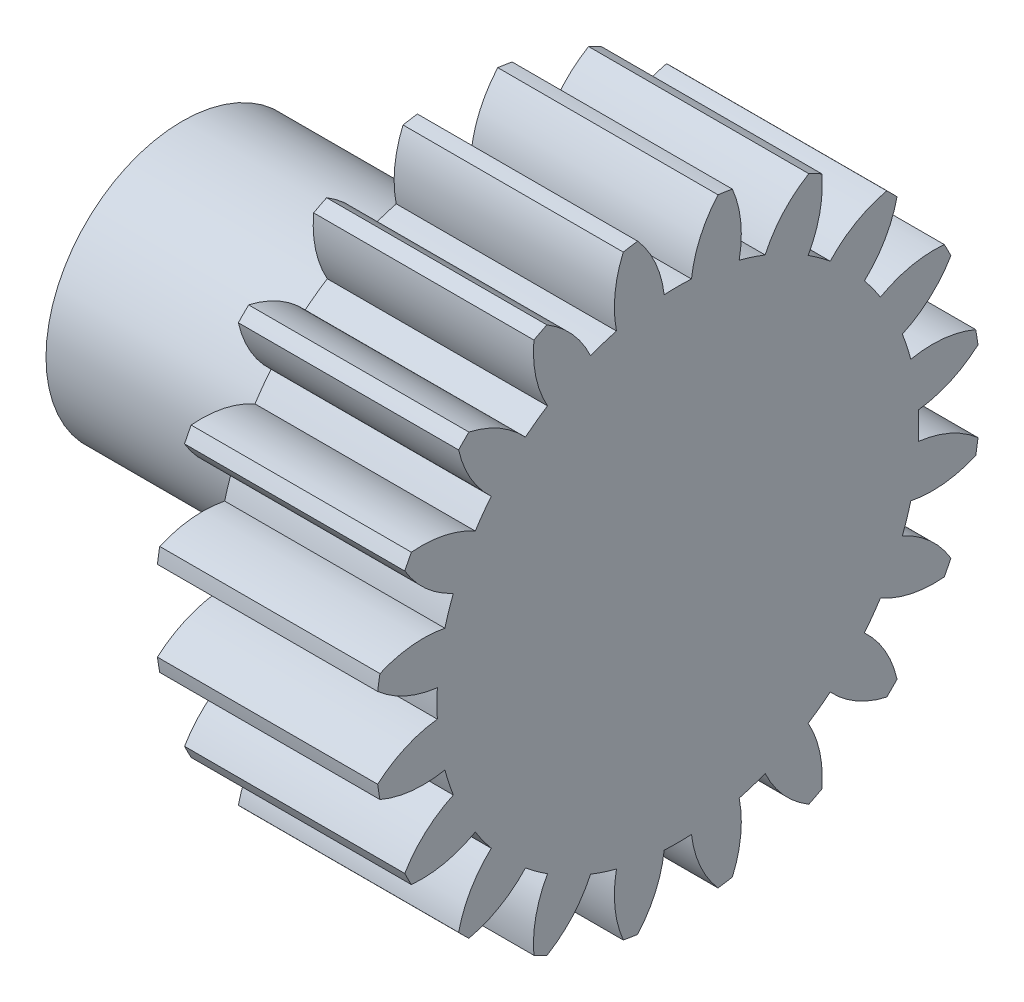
from build123d import *

# Parameters (mm, degrees)
BASPROSKE_W         = 20
BASPROSKE_H         = 27.5
TOOTHCUT_DEPTH      = 44.732139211
TEETHCUTS_COUNT     = 20
TEETHCUTS_ANGLE     = 342
SCALE1_SCALE        = 0.6
SKETCH2_R           = 7.425
BOSS_EXTRUDE1_DEPTH = 15
SKETCH3_R           = 5.425
CUT_EXTRUDE1_DEPTH  = 15


with BuildPart() as part:
    # BasProSke → Base-Revolve (revolve)
    with BuildSketch(Plane(origin=(0, 0, 0), x_dir=(1, 0, 0), z_dir=(0, 1, 0)), mode=Mode.PRIVATE) as base_revolve_sk:
        with Locations((10, 13.75)):
            Rectangle(BASPROSKE_W, BASPROSKE_H)
    revolve(base_revolve_sk.sketch.rotate(Axis((-10, 0, 0), (1, 0, 0)), 180), axis=Axis((-10, 0, 0), (1, 0, 0)))

    # TooCutSke → ToothCut (cut, through all)
    with BuildSketch(Plane(origin=(0, 0, 0), x_dir=(0, 0, -1), z_dir=(1, 0, 0))):
        with BuildLine():
            ThreePointArc((1.237725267, 21.838954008), (0, 21.874), (-1.237725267, 21.838954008))
            ThreePointArc((-1.237725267, 21.838954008), (-2.037783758, 24.744650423), (-3.667234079, 27.280011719))
            ThreePointArc((-3.667234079, 27.280011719), (0, 27.5254), (3.667234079, 27.280011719))
            ThreePointArc((3.667234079, 27.280011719), (2.037783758, 24.744650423), (1.237725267, 21.838954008))
        make_face()
    toothcut = extrude(amount=TOOTHCUT_DEPTH, mode=Mode.SUBTRACT)

    # TeethCuts: ToothCut ×20 about axis
    teethcuts_axis = Axis((-10, 0, 0), (1, 0, 0))
    for i in range(1, TEETHCUTS_COUNT):
        add(toothcut.rotate(teethcuts_axis, i * TEETHCUTS_ANGLE / (TEETHCUTS_COUNT - 1)), mode=Mode.SUBTRACT)


with BuildPart() as part_1:
    # Scale1: scaled about (10, 0, 0)
    add(part.part.scale(SCALE1_SCALE).moved(Location((4, 0, 0))))

    # Sketch2 → Boss-Extrude1 (add)
    with BuildSketch(Plane.ZY.offset(-4)):
        with Locations(Location((0, 0, 0), (0, 0, 180))):
            Circle(SKETCH2_R)
    extrude(amount=BOSS_EXTRUDE1_DEPTH)

    # Sketch3 → Cut-Extrude1 (cut)
    with BuildSketch(Plane.ZY.offset(11)):
        Circle(SKETCH3_R)
    extrude(amount=-CUT_EXTRUDE1_DEPTH, mode=Mode.SUBTRACT)


solid = part_1.part
